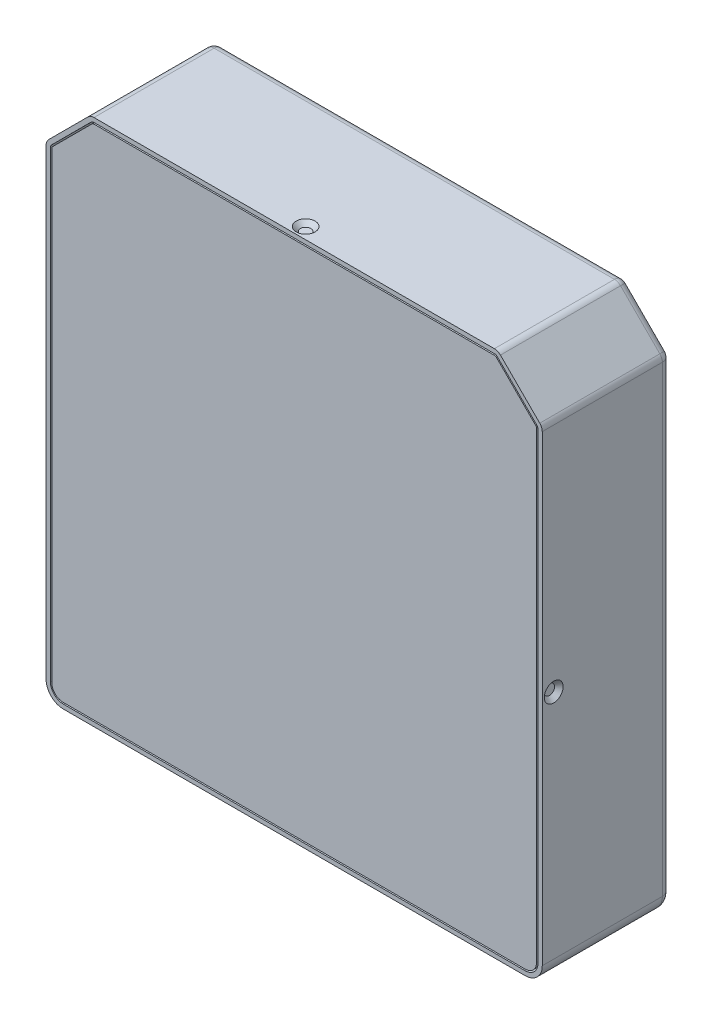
from build123d import *

# Parameters (mm, degrees)
EXTRUDE_1_DEPTH           = 45
FILLET_1_R                = 3
SHELL_1_T                 = -1.5
HOLE_WIZARD_2_D           = 3.4
HOLE_WIZARD_2_DEPTH       = 15.75
HOLE_WIZARD_2_CSINK_D     = 6.6
HOLE_WIZARD_2_CSINK_ANGLE = 90
HOLE_WIZARD_2_TIP         = 1.021463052
HOLE_WIZARD_3_D           = 3.4
HOLE_WIZARD_3_DEPTH       = 15.75
HOLE_WIZARD_3_CSINK_D     = 6.6
HOLE_WIZARD_3_CSINK_ANGLE = 90
HOLE_WIZARD_3_TIP         = 1.021463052
EXTRUDE_2_DEPTH           = 12


with BuildPart() as part:
    # Sketch 1 → Extrude 1 (new body)
    with BuildSketch(Plane.XY):
        with BuildLine():
            Line((-80.749999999, 0), (80.749999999, 0))
            ThreePointArc((80.749999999, 0), (84.992640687, 1.757359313), (86.749999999, 6))
            Line((86.749999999, 6), (86.749999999, 167.757359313))
            ThreePointArc((86.749999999, 167.757359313), (86.521638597, 168.90540961), (85.871320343, 169.878679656))
            Line((85.871320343, 169.878679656), (72.128679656, 183.621320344))
            ThreePointArc((72.128679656, 183.621320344), (71.155409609, 184.271638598), (70.007359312, 184.5))
            Line((70.007359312, 184.5), (-70.007359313, 184.5))
            ThreePointArc((-70.007359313, 184.5), (-71.155409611, 184.271638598), (-72.128679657, 183.621320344))
            Line((-72.128679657, 183.621320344), (-85.871320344, 169.878679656))
            ThreePointArc((-85.871320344, 169.878679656), (-86.521638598, 168.90540961), (-86.750000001, 167.757359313))
            Line((-86.750000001, 167.757359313), (-86.750000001, 6))
            ThreePointArc((-86.750000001, 6), (-84.992640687, 1.757359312), (-80.749999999, 0))
        make_face()
    extrude(amount=EXTRUDE_1_DEPTH)

    # Fillet 1
    fillet_1_edges = [part.edges().sort_by_distance(p)[0] for p in [
        (-86.750000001, 86.878679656, 0),
        (-86.521638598, 168.90540961, 0),
        (-79.000000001, 176.75, 0),
        (-71.155409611, 184.271638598, 0),
        (-1e-09, 184.5, 0),
        (71.155409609, 184.271638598, 0),
        (78.999999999, 176.75, 0),
        (86.521638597, 168.90540961, 0),
        (86.749999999, 86.878679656, 0),
        (84.992640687, 1.757359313, 0),
        (0, 0, 0),
        (-84.992640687, 1.757359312, 0),
    ]]
    fillet(fillet_1_edges, radius=FILLET_1_R)

    # Shell 1
    shell_1_openings = [part.faces().sort_by_distance(p)[0] for p in [
        (-1e-09, 91.633313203, 45),
    ]]
    offset(amount=SHELL_1_T, openings=shell_1_openings, kind=Kind.INTERSECTION)

    # Sketch 3 → Hole Wizard 1 (revolve, cut)
    with BuildSketch(Plane(origin=(-86.750000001, 86.878679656, 41), x_dir=(0, 0, 1), z_dir=(0, 1, 0))):
        Polygon((0, 0), (0, 16.771463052), (1.7, 15.75), (1.7, 1.6), (3.3, 0), align=None)
    hole_wizard_1 = revolve(axis=Axis((-93.100000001, 86.878679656, 41), (1, 0, 0)), mode=Mode.SUBTRACT)

    # Mirror 1: Hole Wizard 1 across plane
    add(hole_wizard_1.mirror(Plane(origin=(0, 0, 0), x_dir=(0, 0, 1), z_dir=(1, 0, 0))), mode=Mode.SUBTRACT)

    # Hole Wizard 2
    with Locations(Plane(origin=(0, 184.5, 0), x_dir=(1, 0, 0), z_dir=(0, 1, 0))):
        with Locations((0, -41)):
            CounterSinkHole(HOLE_WIZARD_2_D / 2, HOLE_WIZARD_2_CSINK_D / 2, depth=HOLE_WIZARD_2_DEPTH, counter_sink_angle=HOLE_WIZARD_2_CSINK_ANGLE)
            with Locations((0, 0, -(HOLE_WIZARD_2_DEPTH + HOLE_WIZARD_2_TIP / 2))):  # 118° drill point
                Cone(0, HOLE_WIZARD_2_D / 2, HOLE_WIZARD_2_TIP, mode=Mode.SUBTRACT)

    # Hole Wizard 3
    with Locations(Plane(origin=(0, 0, 0), x_dir=(-1, 0, 0), z_dir=(0, -1, 0))):
        with Locations((0, -41)):
            CounterSinkHole(HOLE_WIZARD_3_D / 2, HOLE_WIZARD_3_CSINK_D / 2, depth=HOLE_WIZARD_3_DEPTH, counter_sink_angle=HOLE_WIZARD_3_CSINK_ANGLE)
            with Locations((0, 0, -(HOLE_WIZARD_3_DEPTH + HOLE_WIZARD_3_TIP / 2))):  # 118° drill point
                Cone(0, HOLE_WIZARD_3_D / 2, HOLE_WIZARD_3_TIP, mode=Mode.SUBTRACT)


with BuildPart() as body_2:
    # Sketch 9 → Extrude 2 (new body)
    with BuildSketch(Plane.XY.offset(45)):
        with BuildLine():
            Line((-80.75, 2), (80.749999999, 2))
            ThreePointArc((80.749999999, 2), (83.578427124, 3.171572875), (84.749999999, 6))
            Line((84.749999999, 6), (84.749999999, 167.757359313))
            ThreePointArc((84.749999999, 167.757359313), (84.673879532, 168.140042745), (84.457106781, 168.464466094))
            Line((84.457106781, 168.464466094), (70.714466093, 182.207106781))
            ThreePointArc((70.714466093, 182.207106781), (70.390042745, 182.423879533), (70.007359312, 182.5))
            Line((70.007359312, 182.5), (-70.007359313, 182.5))
            ThreePointArc((-70.007359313, 182.5), (-70.390042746, 182.423879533), (-70.714466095, 182.207106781))
            Line((-70.714466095, 182.207106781), (-84.457106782, 168.464466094))
            ThreePointArc((-84.457106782, 168.464466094), (-84.673879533, 168.140042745), (-84.750000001, 167.757359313))
            Line((-84.750000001, 167.757359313), (-84.750000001, 6))
            ThreePointArc((-84.750000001, 6), (-83.578427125, 3.171572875), (-80.75, 2))
        make_face()
    extrude(amount=-EXTRUDE_2_DEPTH)


solid = Compound([part.part, body_2.part])
